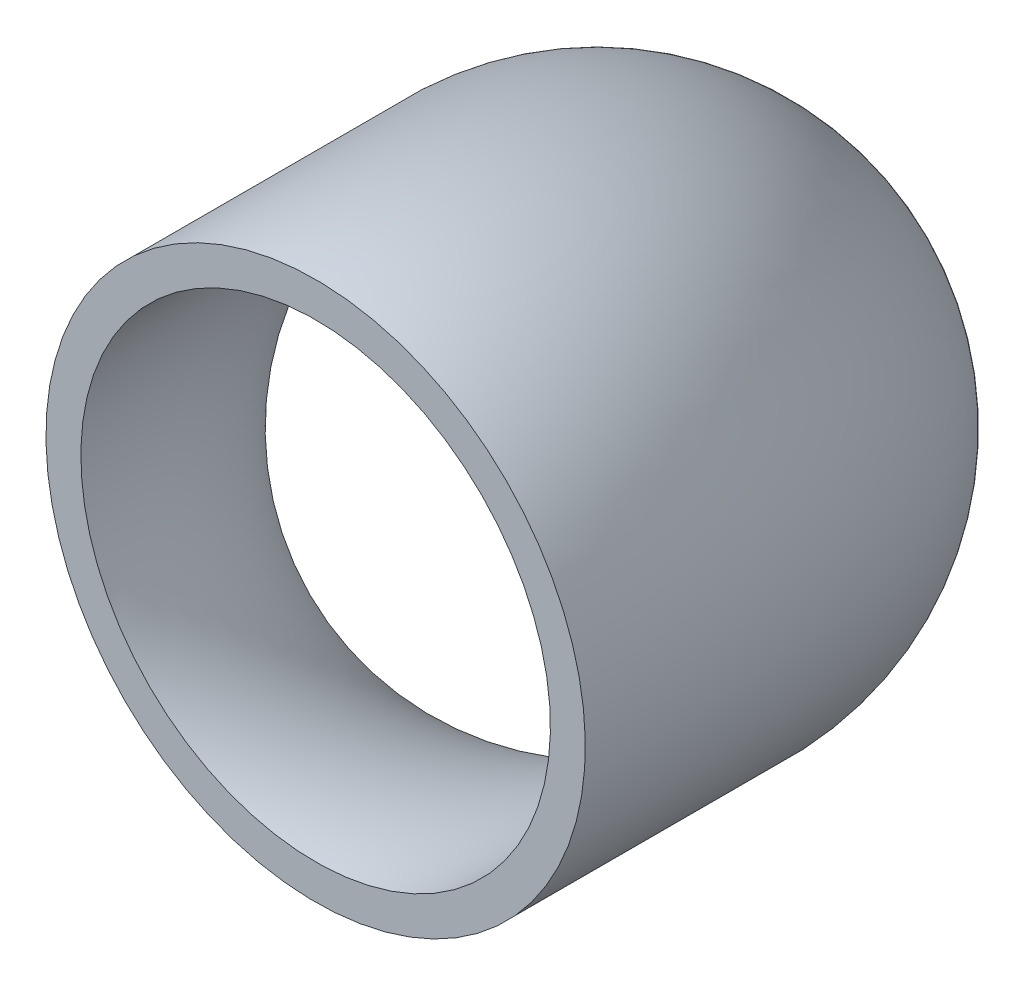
ISO-10303-21;
HEADER;
FILE_DESCRIPTION(('STEP AP214'),'2;1');
FILE_NAME('part.step','',(''),(''),'','','');
FILE_SCHEMA(('AUTOMOTIVE_DESIGN { 1 0 10303 214 1 1 1 1 }'));
ENDSEC;
DATA;
#1=APPLICATION_CONTEXT('core data for automotive mechanical design processes');
#2=APPLICATION_PROTOCOL_DEFINITION('international standard','automotive_design',2000,#1);
#3=PRODUCT_CONTEXT('',#1,'mechanical');
#4=PRODUCT('Part','Part','',(#3));
#5=PRODUCT_RELATED_PRODUCT_CATEGORY('part','',(#4));
#6=PRODUCT_DEFINITION_FORMATION('','',#4);
#7=PRODUCT_DEFINITION_CONTEXT('part definition',#1,'design');
#8=PRODUCT_DEFINITION('design','',#6,#7);
#9=PRODUCT_DEFINITION_SHAPE('','',#8);
#10=(LENGTH_UNIT() NAMED_UNIT(*) SI_UNIT(.MILLI.,.METRE.));
#11=(NAMED_UNIT(*) PLANE_ANGLE_UNIT() SI_UNIT($,.RADIAN.));
#12=(NAMED_UNIT(*) SI_UNIT($,.STERADIAN.) SOLID_ANGLE_UNIT());
#13=UNCERTAINTY_MEASURE_WITH_UNIT(LENGTH_MEASURE(1.E-05),#10,'distance_accuracy_value','');
#14=(GEOMETRIC_REPRESENTATION_CONTEXT(3) GLOBAL_UNCERTAINTY_ASSIGNED_CONTEXT((#13)) GLOBAL_UNIT_ASSIGNED_CONTEXT((#10,
#11,#12)) REPRESENTATION_CONTEXT('',''));
#15=CARTESIAN_POINT('',(0.,0.,0.));
#16=DIRECTION('',(0.,0.,1.));
#17=DIRECTION('',(1.,0.,0.));
#18=AXIS2_PLACEMENT_3D('',#15,#16,#17);
#19=CARTESIAN_POINT('',(-43.1052293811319,-43.1052293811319,0.));
#20=DIRECTION('',(0.707106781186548,-0.707106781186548,0.));
#21=DIRECTION('',(0.707106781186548,0.707106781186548,0.));
#22=AXIS2_PLACEMENT_3D('',#19,#20,#21);
#23=TOROIDAL_SURFACE('',#22,60.96,26.3144);
#24=CARTESIAN_POINT('',(-43.1052293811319,-43.1052293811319,-60.96));
#25=DIRECTION('',(0.707106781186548,0.707106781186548,0.));
#26=DIRECTION('',(0.5,-0.5,-0.707106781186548));
#27=AXIS2_PLACEMENT_3D('',#24,#25,#26);
#28=CIRCLE('',#27,26.3144);
#29=CARTESIAN_POINT('',(-43.1052293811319,-43.1052293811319,-87.2744));
#30=VERTEX_POINT('',#29);
#31=EDGE_CURVE('E36',#30,#30,#28,.T.);
#32=CARTESIAN_POINT('',(0.,0.,0.));
#33=DIRECTION('',(0.,0.,1.));
#34=DIRECTION('',(1.,0.,0.));
#35=AXIS2_PLACEMENT_3D('',#32,#33,#34);
#36=CIRCLE('',#35,26.3144);
#37=CARTESIAN_POINT('',(18.6070906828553,18.6070906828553,0.));
#38=VERTEX_POINT('',#37);
#39=EDGE_CURVE('E44',#38,#38,#36,.T.);
#40=CARTESIAN_POINT('',(-43.1052293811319,-43.1052293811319,0.));
#41=DIRECTION('',(0.707106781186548,-0.707106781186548,0.));
#42=DIRECTION('',(0.707106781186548,0.707106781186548,0.));
#43=AXIS2_PLACEMENT_3D('',#40,#41,#42);
#44=CIRCLE('',#43,87.2744);
#45=EDGE_CURVE('',#30,#38,#44,.T.);
#46=ORIENTED_EDGE('',*,*,#31,.F.);
#47=ORIENTED_EDGE('',*,*,#39,.T.);
#48=ORIENTED_EDGE('',*,*,#45,.T.);
#49=ORIENTED_EDGE('',*,*,#45,.F.);
#50=EDGE_LOOP('',(#46,#48,#47,#49));
#51=FACE_BOUND('',#50,.T.);
#52=ADVANCED_FACE('F29',(#51),#23,.F.);
#53=CARTESIAN_POINT('',(-43.1052293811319,-43.1052293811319,0.));
#54=DIRECTION('',(0.707106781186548,-0.707106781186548,0.));
#55=DIRECTION('',(0.707106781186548,0.707106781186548,0.));
#56=AXIS2_PLACEMENT_3D('',#53,#54,#55);
#57=TOROIDAL_SURFACE('',#56,60.96,30.226);
#58=CARTESIAN_POINT('',(-43.1052293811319,-43.1052293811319,-60.96));
#59=DIRECTION('',(0.707106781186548,0.707106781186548,0.));
#60=DIRECTION('',(0.5,-0.5,-0.707106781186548));
#61=AXIS2_PLACEMENT_3D('',#58,#59,#60);
#62=CIRCLE('',#61,30.226);
#63=CARTESIAN_POINT('',(-43.1052293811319,-43.1052293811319,-91.186));
#64=VERTEX_POINT('',#63);
#65=EDGE_CURVE('E10',#64,#64,#62,.T.);
#66=CARTESIAN_POINT('',(0.,0.,0.));
#67=DIRECTION('',(0.,0.,1.));
#68=DIRECTION('',(1.,0.,0.));
#69=AXIS2_PLACEMENT_3D('',#66,#67,#68);
#70=CIRCLE('',#69,30.226);
#71=CARTESIAN_POINT('',(21.3730095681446,21.3730095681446,0.));
#72=VERTEX_POINT('',#71);
#73=EDGE_CURVE('E40',#72,#72,#70,.T.);
#74=CARTESIAN_POINT('',(-43.1052293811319,-43.1052293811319,0.));
#75=DIRECTION('',(0.707106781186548,-0.707106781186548,0.));
#76=DIRECTION('',(0.707106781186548,0.707106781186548,0.));
#77=AXIS2_PLACEMENT_3D('',#74,#75,#76);
#78=CIRCLE('',#77,91.186);
#79=EDGE_CURVE('',#64,#72,#78,.T.);
#80=ORIENTED_EDGE('',*,*,#65,.T.);
#81=ORIENTED_EDGE('',*,*,#73,.F.);
#82=ORIENTED_EDGE('',*,*,#79,.T.);
#83=ORIENTED_EDGE('',*,*,#79,.F.);
#84=EDGE_LOOP('',(#80,#82,#81,#83));
#85=FACE_BOUND('',#84,.T.);
#86=ADVANCED_FACE('F31',(#85),#57,.T.);
#87=CARTESIAN_POINT('',(-43.1052293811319,-43.1052293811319,-60.96));
#88=DIRECTION('',(0.707106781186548,0.707106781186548,0.));
#89=DIRECTION('',(0.5,-0.5,-0.707106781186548));
#90=AXIS2_PLACEMENT_3D('',#87,#88,#89);
#91=PLANE('',#90);
#92=ORIENTED_EDGE('',*,*,#31,.T.);
#93=EDGE_LOOP('',(#92));
#94=FACE_BOUND('',#93,.T.);
#95=ORIENTED_EDGE('',*,*,#65,.F.);
#96=EDGE_LOOP('',(#95));
#97=FACE_BOUND('',#96,.T.);
#98=ADVANCED_FACE('F54',(#94,#97),#91,.F.);
#99=CARTESIAN_POINT('',(0.,0.,0.));
#100=DIRECTION('',(0.,0.,1.));
#101=DIRECTION('',(1.,0.,0.));
#102=AXIS2_PLACEMENT_3D('',#99,#100,#101);
#103=PLANE('',#102);
#104=ORIENTED_EDGE('',*,*,#39,.F.);
#105=EDGE_LOOP('',(#104));
#106=FACE_BOUND('',#105,.T.);
#107=ORIENTED_EDGE('',*,*,#73,.T.);
#108=EDGE_LOOP('',(#107));
#109=FACE_BOUND('',#108,.T.);
#110=ADVANCED_FACE('F51',(#106,#109),#103,.T.);
#111=CLOSED_SHELL('',(#52,#86,#98,#110));
#112=MANIFOLD_SOLID_BREP('B2',#111);
#113=ADVANCED_BREP_SHAPE_REPRESENTATION('',(#18,#112),#14);
#114=SHAPE_DEFINITION_REPRESENTATION(#9,#113);
ENDSEC;
END-ISO-10303-21;
